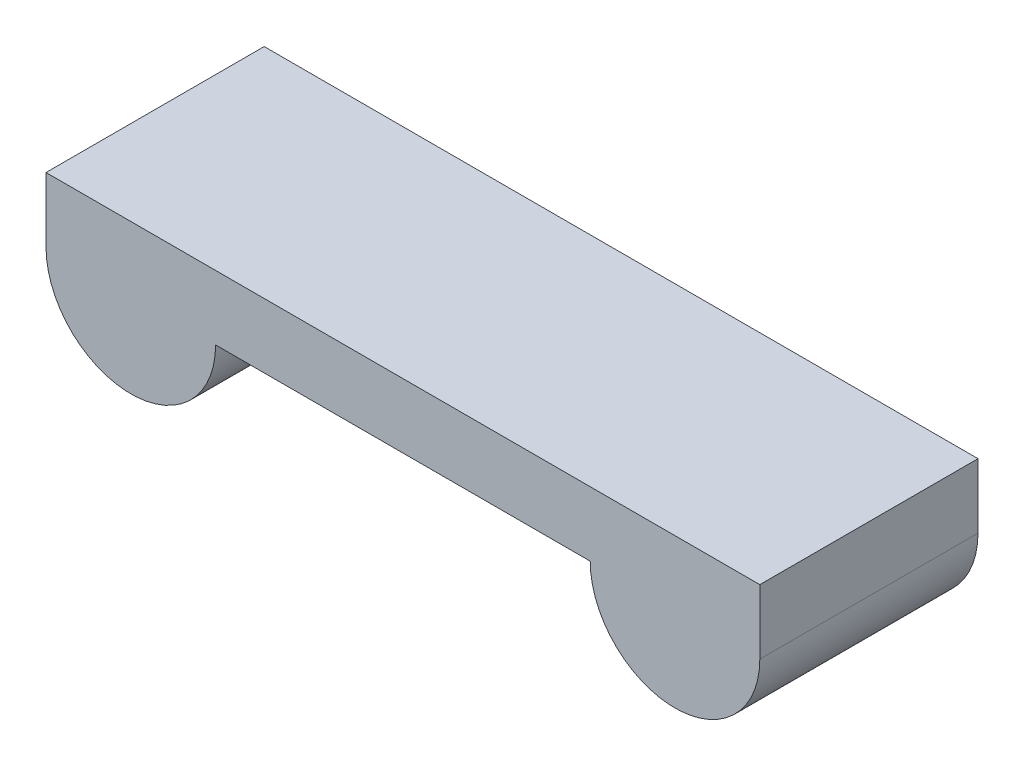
ISO-10303-21;
HEADER;
FILE_DESCRIPTION(('STEP AP214'),'2;1');
FILE_NAME('part.step','',(''),(''),'','','');
FILE_SCHEMA(('AUTOMOTIVE_DESIGN { 1 0 10303 214 1 1 1 1 }'));
ENDSEC;
DATA;
#1=APPLICATION_CONTEXT('core data for automotive mechanical design processes');
#2=APPLICATION_PROTOCOL_DEFINITION('international standard','automotive_design',2000,#1);
#3=PRODUCT_CONTEXT('',#1,'mechanical');
#4=PRODUCT('Part','Part','',(#3));
#5=PRODUCT_RELATED_PRODUCT_CATEGORY('part','',(#4));
#6=PRODUCT_DEFINITION_FORMATION('','',#4);
#7=PRODUCT_DEFINITION_CONTEXT('part definition',#1,'design');
#8=PRODUCT_DEFINITION('design','',#6,#7);
#9=PRODUCT_DEFINITION_SHAPE('','',#8);
#10=(LENGTH_UNIT() NAMED_UNIT(*) SI_UNIT(.MILLI.,.METRE.));
#11=(NAMED_UNIT(*) PLANE_ANGLE_UNIT() SI_UNIT($,.RADIAN.));
#12=(NAMED_UNIT(*) SI_UNIT($,.STERADIAN.) SOLID_ANGLE_UNIT());
#13=UNCERTAINTY_MEASURE_WITH_UNIT(LENGTH_MEASURE(1.E-05),#10,'distance_accuracy_value','');
#14=(GEOMETRIC_REPRESENTATION_CONTEXT(3) GLOBAL_UNCERTAINTY_ASSIGNED_CONTEXT((#13)) GLOBAL_UNIT_ASSIGNED_CONTEXT((#10,
#11,#12)) REPRESENTATION_CONTEXT('',''));
#15=CARTESIAN_POINT('',(0.,0.,0.));
#16=DIRECTION('',(0.,0.,1.));
#17=DIRECTION('',(1.,0.,0.));
#18=AXIS2_PLACEMENT_3D('',#15,#16,#17);
#19=CARTESIAN_POINT('',(-49.0772173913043,-8.86791304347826,15.));
#20=DIRECTION('',(1.,0.,0.));
#21=DIRECTION('',(0.,0.,-1.));
#22=AXIS2_PLACEMENT_3D('',#19,#20,#21);
#23=PLANE('',#22);
#24=DIRECTION('',(0.,-1.,0.));
#25=VECTOR('',#24,1.);
#26=CARTESIAN_POINT('',(-49.0772173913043,-8.86791304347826,-15.));
#27=LINE('',#26,#25);
#28=CARTESIAN_POINT('',(-49.0772173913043,0.,-15.));
#29=VERTEX_POINT('',#28);
#30=CARTESIAN_POINT('',(-49.0772173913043,-8.86791304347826,-15.));
#31=VERTEX_POINT('',#30);
#32=EDGE_CURVE('E115',#29,#31,#27,.T.);
#33=ORIENTED_EDGE('',*,*,#32,.T.);
#34=DIRECTION('',(0.,0.,-1.));
#35=VECTOR('',#34,1.);
#36=CARTESIAN_POINT('',(-49.0772173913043,-8.86791304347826,15.));
#37=LINE('',#36,#35);
#38=CARTESIAN_POINT('',(-49.0772173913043,-8.86791304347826,15.));
#39=VERTEX_POINT('',#38);
#40=EDGE_CURVE('E11',#39,#31,#37,.T.);
#41=ORIENTED_EDGE('',*,*,#40,.F.);
#42=DIRECTION('',(0.,-1.,0.));
#43=VECTOR('',#42,1.);
#44=CARTESIAN_POINT('',(-49.0772173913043,-8.86791304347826,15.));
#45=LINE('',#44,#43);
#46=CARTESIAN_POINT('',(-49.0772173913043,0.,15.));
#47=VERTEX_POINT('',#46);
#48=EDGE_CURVE('E125',#47,#39,#45,.T.);
#49=ORIENTED_EDGE('',*,*,#48,.F.);
#50=DIRECTION('',(0.,0.,-1.));
#51=VECTOR('',#50,1.);
#52=CARTESIAN_POINT('',(-49.0772173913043,0.,15.));
#53=LINE('',#52,#51);
#54=EDGE_CURVE('E111',#47,#29,#53,.T.);
#55=ORIENTED_EDGE('',*,*,#54,.T.);
#56=EDGE_LOOP('',(#33,#41,#49,#55));
#57=FACE_BOUND('',#56,.T.);
#58=ADVANCED_FACE('F31',(#57),#23,.F.);
#59=CARTESIAN_POINT('',(-37.4153043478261,-8.86791304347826,15.));
#60=DIRECTION('',(0.,0.,-1.));
#61=DIRECTION('',(-1.,0.,0.));
#62=AXIS2_PLACEMENT_3D('',#59,#60,#61);
#63=CYLINDRICAL_SURFACE('',#62,11.6619130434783);
#64=CARTESIAN_POINT('',(-37.4153043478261,-8.86791304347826,-15.));
#65=DIRECTION('',(0.,0.,1.));
#66=DIRECTION('',(-1.,0.,0.));
#67=AXIS2_PLACEMENT_3D('',#64,#65,#66);
#68=CIRCLE('',#67,11.6619130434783);
#69=CARTESIAN_POINT('',(-25.7533913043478,-8.86791304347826,-15.));
#70=VERTEX_POINT('',#69);
#71=EDGE_CURVE('E118',#31,#70,#68,.T.);
#72=ORIENTED_EDGE('',*,*,#71,.T.);
#73=DIRECTION('',(0.,0.,-1.));
#74=VECTOR('',#73,1.);
#75=CARTESIAN_POINT('',(-25.7533913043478,-8.86791304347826,15.));
#76=LINE('',#75,#74);
#77=CARTESIAN_POINT('',(-25.7533913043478,-8.86791304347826,15.));
#78=VERTEX_POINT('',#77);
#79=EDGE_CURVE('E39',#78,#70,#76,.T.);
#80=ORIENTED_EDGE('',*,*,#79,.F.);
#81=CARTESIAN_POINT('',(-37.4153043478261,-8.86791304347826,15.));
#82=DIRECTION('',(0.,0.,1.));
#83=DIRECTION('',(-1.,0.,0.));
#84=AXIS2_PLACEMENT_3D('',#81,#82,#83);
#85=CIRCLE('',#84,11.6619130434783);
#86=EDGE_CURVE('E84',#39,#78,#85,.T.);
#87=ORIENTED_EDGE('',*,*,#86,.F.);
#88=ORIENTED_EDGE('',*,*,#40,.T.);
#89=EDGE_LOOP('',(#72,#80,#87,#88));
#90=FACE_BOUND('',#89,.T.);
#91=ADVANCED_FACE('F149',(#90),#63,.T.);
#92=CARTESIAN_POINT('',(25.7533913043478,-8.86791304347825,15.));
#93=DIRECTION('',(0.,1.,0.));
#94=DIRECTION('',(-1.,0.,0.));
#95=AXIS2_PLACEMENT_3D('',#92,#93,#94);
#96=PLANE('',#95);
#97=DIRECTION('',(1.,0.,0.));
#98=VECTOR('',#97,1.);
#99=CARTESIAN_POINT('',(25.7533913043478,-8.86791304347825,-15.));
#100=LINE('',#99,#98);
#101=CARTESIAN_POINT('',(25.7533913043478,-8.86791304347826,-15.));
#102=VERTEX_POINT('',#101);
#103=EDGE_CURVE('E120',#70,#102,#100,.T.);
#104=ORIENTED_EDGE('',*,*,#103,.T.);
#105=DIRECTION('',(0.,0.,-1.));
#106=VECTOR('',#105,1.);
#107=CARTESIAN_POINT('',(25.7533913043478,-8.86791304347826,15.));
#108=LINE('',#107,#106);
#109=CARTESIAN_POINT('',(25.7533913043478,-8.86791304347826,15.));
#110=VERTEX_POINT('',#109);
#111=EDGE_CURVE('E106',#110,#102,#108,.T.);
#112=ORIENTED_EDGE('',*,*,#111,.F.);
#113=DIRECTION('',(1.,0.,0.));
#114=VECTOR('',#113,1.);
#115=CARTESIAN_POINT('',(25.7533913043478,-8.86791304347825,15.));
#116=LINE('',#115,#114);
#117=EDGE_CURVE('E97',#78,#110,#116,.T.);
#118=ORIENTED_EDGE('',*,*,#117,.F.);
#119=ORIENTED_EDGE('',*,*,#79,.T.);
#120=EDGE_LOOP('',(#104,#112,#118,#119));
#121=FACE_BOUND('',#120,.T.);
#122=ADVANCED_FACE('F131',(#121),#96,.F.);
#123=CARTESIAN_POINT('',(37.4153043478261,-8.86791304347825,15.));
#124=DIRECTION('',(0.,0.,-1.));
#125=DIRECTION('',(-1.,0.,0.));
#126=AXIS2_PLACEMENT_3D('',#123,#124,#125);
#127=CYLINDRICAL_SURFACE('',#126,11.6619130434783);
#128=CARTESIAN_POINT('',(37.4153043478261,-8.86791304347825,-15.));
#129=DIRECTION('',(0.,0.,1.));
#130=DIRECTION('',(-1.,0.,0.));
#131=AXIS2_PLACEMENT_3D('',#128,#129,#130);
#132=CIRCLE('',#131,11.6619130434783);
#133=CARTESIAN_POINT('',(49.0772173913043,-8.86791304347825,-15.));
#134=VERTEX_POINT('',#133);
#135=EDGE_CURVE('E105',#102,#134,#132,.T.);
#136=ORIENTED_EDGE('',*,*,#135,.T.);
#137=DIRECTION('',(0.,0.,-1.));
#138=VECTOR('',#137,1.);
#139=CARTESIAN_POINT('',(49.0772173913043,-8.86791304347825,15.));
#140=LINE('',#139,#138);
#141=CARTESIAN_POINT('',(49.0772173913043,-8.86791304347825,15.));
#142=VERTEX_POINT('',#141);
#143=EDGE_CURVE('E102',#142,#134,#140,.T.);
#144=ORIENTED_EDGE('',*,*,#143,.F.);
#145=CARTESIAN_POINT('',(37.4153043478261,-8.86791304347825,15.));
#146=DIRECTION('',(0.,0.,1.));
#147=DIRECTION('',(-1.,0.,0.));
#148=AXIS2_PLACEMENT_3D('',#145,#146,#147);
#149=CIRCLE('',#148,11.6619130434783);
#150=EDGE_CURVE('E91',#110,#142,#149,.T.);
#151=ORIENTED_EDGE('',*,*,#150,.F.);
#152=ORIENTED_EDGE('',*,*,#111,.T.);
#153=EDGE_LOOP('',(#136,#144,#151,#152));
#154=FACE_BOUND('',#153,.T.);
#155=ADVANCED_FACE('F103',(#154),#127,.T.);
#156=CARTESIAN_POINT('',(49.0772173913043,0.,15.));
#157=DIRECTION('',(-1.,0.,0.));
#158=DIRECTION('',(0.,0.,1.));
#159=AXIS2_PLACEMENT_3D('',#156,#157,#158);
#160=PLANE('',#159);
#161=DIRECTION('',(0.,1.,0.));
#162=VECTOR('',#161,1.);
#163=CARTESIAN_POINT('',(49.0772173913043,0.,-15.));
#164=LINE('',#163,#162);
#165=CARTESIAN_POINT('',(49.0772173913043,0.,-15.));
#166=VERTEX_POINT('',#165);
#167=EDGE_CURVE('E70',#134,#166,#164,.T.);
#168=ORIENTED_EDGE('',*,*,#167,.T.);
#169=DIRECTION('',(0.,0.,-1.));
#170=VECTOR('',#169,1.);
#171=CARTESIAN_POINT('',(49.0772173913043,0.,15.));
#172=LINE('',#171,#170);
#173=CARTESIAN_POINT('',(49.0772173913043,0.,15.));
#174=VERTEX_POINT('',#173);
#175=EDGE_CURVE('E107',#174,#166,#172,.T.);
#176=ORIENTED_EDGE('',*,*,#175,.F.);
#177=DIRECTION('',(0.,1.,0.));
#178=VECTOR('',#177,1.);
#179=CARTESIAN_POINT('',(49.0772173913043,0.,15.));
#180=LINE('',#179,#178);
#181=EDGE_CURVE('E95',#142,#174,#180,.T.);
#182=ORIENTED_EDGE('',*,*,#181,.F.);
#183=ORIENTED_EDGE('',*,*,#143,.T.);
#184=EDGE_LOOP('',(#168,#176,#182,#183));
#185=FACE_BOUND('',#184,.T.);
#186=ADVANCED_FACE('F109',(#185),#160,.F.);
#187=CARTESIAN_POINT('',(-49.0772173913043,0.,15.));
#188=DIRECTION('',(0.,-1.,0.));
#189=DIRECTION('',(0.,0.,-1.));
#190=AXIS2_PLACEMENT_3D('',#187,#188,#189);
#191=PLANE('',#190);
#192=DIRECTION('',(-1.,0.,0.));
#193=VECTOR('',#192,1.);
#194=CARTESIAN_POINT('',(-49.0772173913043,0.,-15.));
#195=LINE('',#194,#193);
#196=EDGE_CURVE('E76',#166,#29,#195,.T.);
#197=ORIENTED_EDGE('',*,*,#196,.T.);
#198=ORIENTED_EDGE('',*,*,#54,.F.);
#199=DIRECTION('',(-1.,0.,0.));
#200=VECTOR('',#199,1.);
#201=CARTESIAN_POINT('',(-49.0772173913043,0.,15.));
#202=LINE('',#201,#200);
#203=EDGE_CURVE('E47',#174,#47,#202,.T.);
#204=ORIENTED_EDGE('',*,*,#203,.F.);
#205=ORIENTED_EDGE('',*,*,#175,.T.);
#206=EDGE_LOOP('',(#197,#198,#204,#205));
#207=FACE_BOUND('',#206,.T.);
#208=ADVANCED_FACE('F138',(#207),#191,.F.);
#209=CARTESIAN_POINT('',(37.4153043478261,-8.86791304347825,15.));
#210=DIRECTION('',(0.,0.,-1.));
#211=DIRECTION('',(-1.,0.,0.));
#212=AXIS2_PLACEMENT_3D('',#209,#210,#211);
#213=PLANE('',#212);
#214=ORIENTED_EDGE('',*,*,#48,.T.);
#215=ORIENTED_EDGE('',*,*,#86,.T.);
#216=ORIENTED_EDGE('',*,*,#117,.T.);
#217=ORIENTED_EDGE('',*,*,#150,.T.);
#218=ORIENTED_EDGE('',*,*,#181,.T.);
#219=ORIENTED_EDGE('',*,*,#203,.T.);
#220=EDGE_LOOP('',(#214,#215,#216,#217,#218,#219));
#221=FACE_BOUND('',#220,.T.);
#222=ADVANCED_FACE('F93',(#221),#213,.F.);
#223=CARTESIAN_POINT('',(37.4153043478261,-8.86791304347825,-15.));
#224=DIRECTION('',(0.,0.,-1.));
#225=DIRECTION('',(-1.,0.,0.));
#226=AXIS2_PLACEMENT_3D('',#223,#224,#225);
#227=PLANE('',#226);
#228=ORIENTED_EDGE('',*,*,#32,.F.);
#229=ORIENTED_EDGE('',*,*,#196,.F.);
#230=ORIENTED_EDGE('',*,*,#167,.F.);
#231=ORIENTED_EDGE('',*,*,#135,.F.);
#232=ORIENTED_EDGE('',*,*,#103,.F.);
#233=ORIENTED_EDGE('',*,*,#71,.F.);
#234=EDGE_LOOP('',(#228,#229,#230,#231,#232,#233));
#235=FACE_BOUND('',#234,.T.);
#236=ADVANCED_FACE('F134',(#235),#227,.T.);
#237=CLOSED_SHELL('',(#58,#91,#122,#155,#186,#208,#222,#236));
#238=MANIFOLD_SOLID_BREP('B2',#237);
#239=ADVANCED_BREP_SHAPE_REPRESENTATION('',(#18,#238),#14);
#240=SHAPE_DEFINITION_REPRESENTATION(#9,#239);
ENDSEC;
END-ISO-10303-21;
